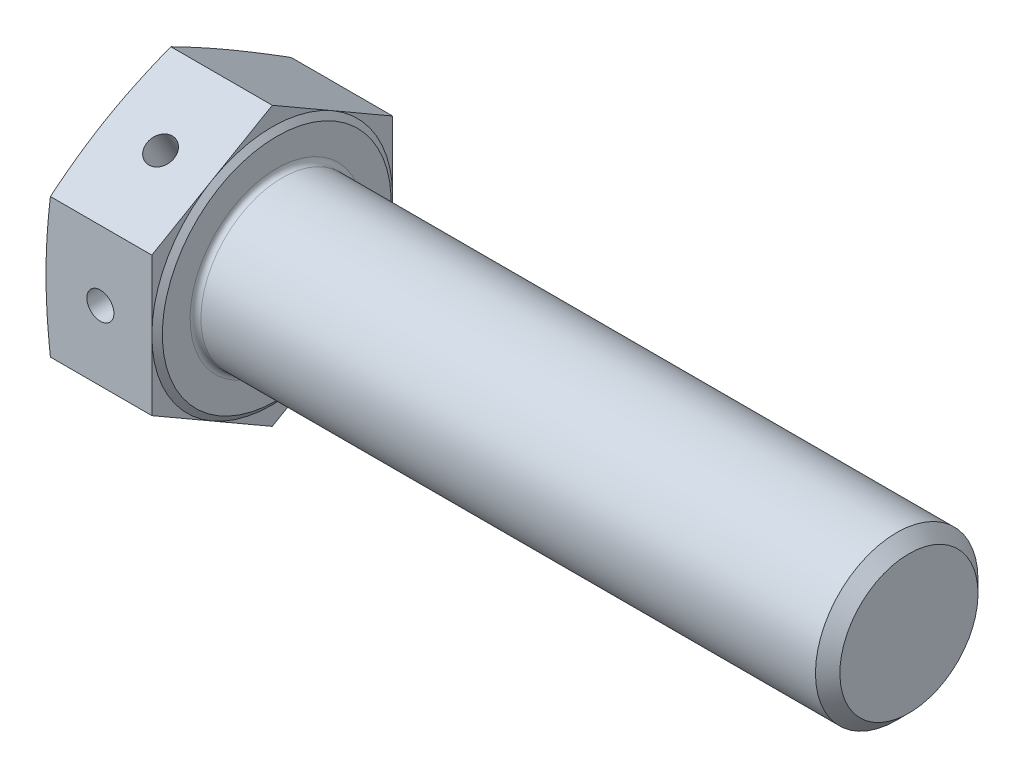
from build123d import *

# Parameters (mm, degrees)
BASEHEAD_DEPTH    = 11.72
SKETCH3_R         = 9
BASEBODY_DEPTH    = 70
CHAMFER1_SIZE     = 1.353
HEADFILLET_R      = 0.6
SKETCH5_R         = 1.5
HOLE_DEPTH        = 85.70564872
CIRPATTERN1_COUNT = 2
CIRPATTERN1_ANGLE = 60


with BuildPart() as part:
    # Sketch-BaseHead → BaseHead (new body)
    with BuildSketch(Plane(origin=(0, 0, 0), x_dir=(0, 0, -1), z_dir=(1, 0, 0))):
        Polygon((0, -15.397931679), (13.335, -7.69896584), (13.335, 7.69896584), (0, 15.397931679), (-13.335, 7.69896584), (-13.335, -7.69896584), align=None)
    extrude(amount=BASEHEAD_DEPTH)

    # Sketch4 → HeadChamfer (revolve, cut)
    with BuildSketch(Plane(origin=(-0.264637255, -5.916896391, 0), x_dir=(0, 1, 0), z_dir=(0, 0, 1))):
        Polygon((21.31482807, -0.264637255), (19.251896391, -0.264637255), (21.31482807, -0.753624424), align=None)
    revolve(axis=Axis((-4.001564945, 0, 0), (1, 0, 0)), mode=Mode.SUBTRACT)

    # Sketch2 → Revolve1 (revolve)
    with BuildSketch(Plane(origin=(0, 0, 0), x_dir=(1, 0, 0), z_dir=(0, 1, 0)), mode=Mode.PRIVATE) as revolve1_sk:
        Polygon((11.72, 0), (12.22, 0), (12.22, 12.67), (11.72, 13.335), align=None)
    revolve(revolve1_sk.sketch.rotate(Axis((-4.001564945, 0, 0), (1, 0, 0)), 270), axis=Axis((-4.001564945, 0, 0), (1, 0, 0)))

    # Sketch3 → BaseBody (add)
    with BuildSketch(Plane(origin=(12.22, 0, 0), x_dir=(0, 0, -1), z_dir=(1, 0, 0))):
        with Locations(Location((0, 0, 0), (0, 0, 270))):
            Circle(SKETCH3_R)
    extrude(amount=BASEBODY_DEPTH)

    # Chamfer1
    chamfer1_edges = [part.edges().sort_by_distance(p)[0] for p in [
        (82.22, 9, 0),
    ]]
    chamfer(chamfer1_edges, length=CHAMFER1_SIZE)

    # HeadFillet
    headfillet_edges = [part.edges().sort_by_distance(p)[0] for p in [
        (12.22, 9, 0),
    ]]
    fillet(headfillet_edges, radius=HEADFILLET_R)

    # Sketch5 → Hole (cut, symmetric)
    with BuildSketch(Plane.XY):
        with Locations((6.02, 0)):
            Circle(SKETCH5_R)
    hole = extrude(amount=HOLE_DEPTH, both=True, mode=Mode.SUBTRACT)

    # CirPattern1: Hole ×2 about axis
    cirpattern1_axis = Axis((82.22, 0, 0), (-1, 0, 0))
    for i in range(1, CIRPATTERN1_COUNT):
        add(hole.rotate(cirpattern1_axis, i * CIRPATTERN1_ANGLE / (CIRPATTERN1_COUNT - 1)), mode=Mode.SUBTRACT)


solid = part.part
